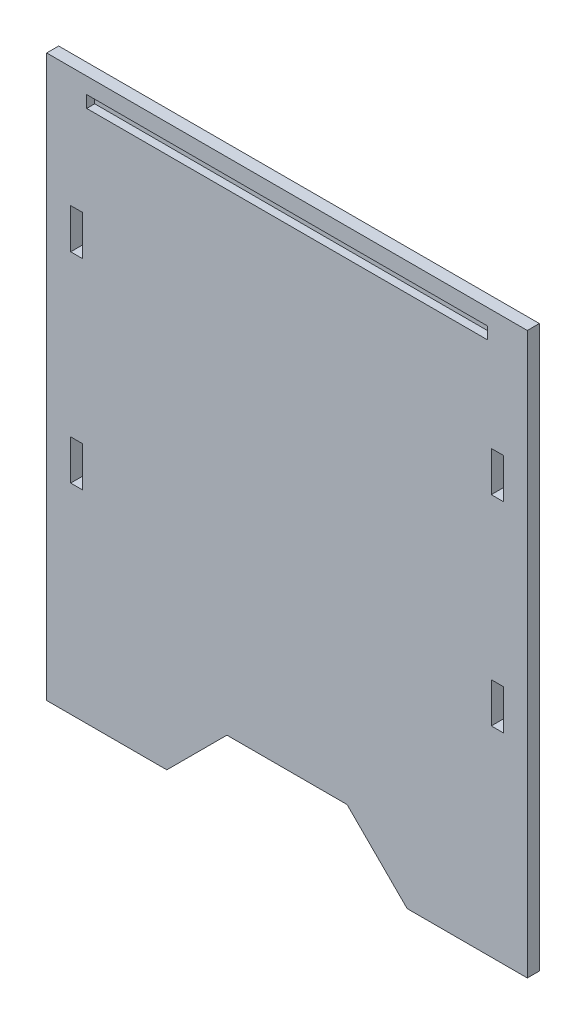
from build123d import *

# Parameters (mm, degrees)
SALIENTE_EXTRUIR1_DEPTH = 15
CROQUIS2_W              = 500
CROQUIS2_H              = 15
CORTAR_EXTRUIR1_DEPTH   = 10
CROQUIS4_W              = 15
CROQUIS4_H              = 50
CROQUIS4_W_2            = 14.5
CORTAR_EXTRUIR2_DEPTH   = 15


with BuildPart() as part:
    # Croquis1 → Saliente-Extruir1 (new body)
    with BuildSketch(Plane.XY):
        Polygon((-150, -350), (-75, -275), (75, -275), (150, -350), (300, -350), (300, 350), (-300, 350), (-300, -350), align=None)
    extrude(amount=SALIENTE_EXTRUIR1_DEPTH)

    # Croquis2 → Cortar-Extruir1 (cut)
    with BuildSketch(Plane.XY.offset(15)):
        with Locations((0, 322.5)):
            Rectangle(CROQUIS2_W, CROQUIS2_H)
    extrude(amount=-CORTAR_EXTRUIR1_DEPTH, mode=Mode.SUBTRACT)

    # Croquis4 → Cortar-Extruir2 (cut)
    with BuildSketch(Plane.XY.offset(15)):
        with Locations((262.5, 175)):
            Rectangle(CROQUIS4_W, CROQUIS4_H)
        with Locations((262.5, -75)):
            Rectangle(CROQUIS4_W, CROQUIS4_H)
        with Locations((-262.75, 175)):
            Rectangle(CROQUIS4_W_2, CROQUIS4_H)
        with Locations((-262.75, -75)):
            Rectangle(CROQUIS4_W_2, CROQUIS4_H)
    extrude(amount=-CORTAR_EXTRUIR2_DEPTH, mode=Mode.SUBTRACT)


solid = part.part
